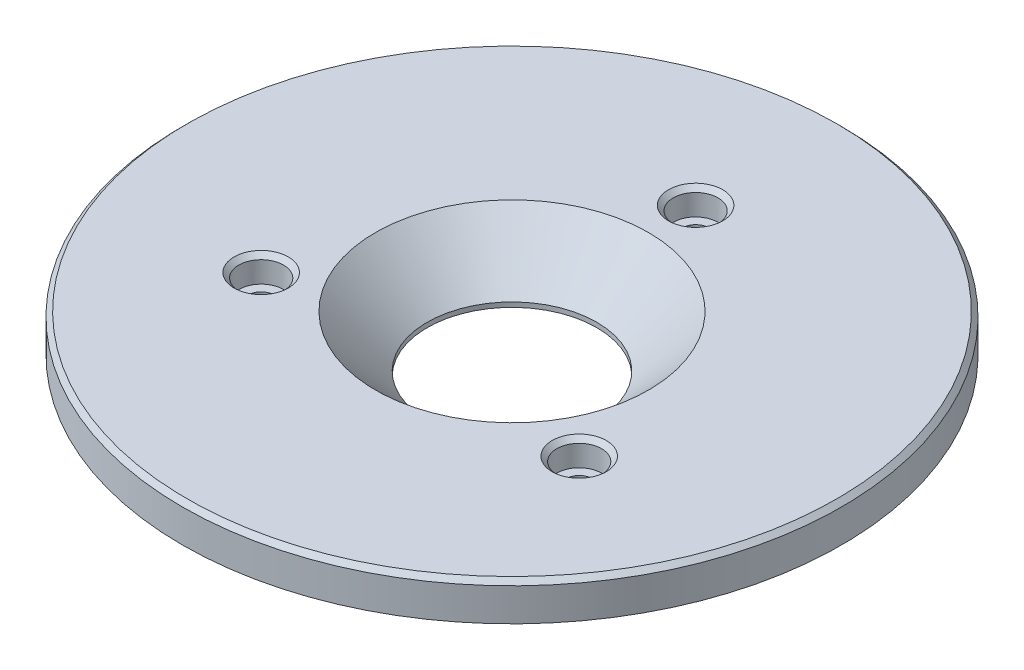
ISO-10303-21;
HEADER;
FILE_DESCRIPTION(('STEP AP214'),'2;1');
FILE_NAME('part.step','',(''),(''),'','','');
FILE_SCHEMA(('AUTOMOTIVE_DESIGN { 1 0 10303 214 1 1 1 1 }'));
ENDSEC;
DATA;
#1=APPLICATION_CONTEXT('core data for automotive mechanical design processes');
#2=APPLICATION_PROTOCOL_DEFINITION('international standard','automotive_design',2000,#1);
#3=PRODUCT_CONTEXT('',#1,'mechanical');
#4=PRODUCT('Part','Part','',(#3));
#5=PRODUCT_RELATED_PRODUCT_CATEGORY('part','',(#4));
#6=PRODUCT_DEFINITION_FORMATION('','',#4);
#7=PRODUCT_DEFINITION_CONTEXT('part definition',#1,'design');
#8=PRODUCT_DEFINITION('design','',#6,#7);
#9=PRODUCT_DEFINITION_SHAPE('','',#8);
#10=(LENGTH_UNIT() NAMED_UNIT(*) SI_UNIT(.MILLI.,.METRE.));
#11=(NAMED_UNIT(*) PLANE_ANGLE_UNIT() SI_UNIT($,.RADIAN.));
#12=(NAMED_UNIT(*) SI_UNIT($,.STERADIAN.) SOLID_ANGLE_UNIT());
#13=UNCERTAINTY_MEASURE_WITH_UNIT(LENGTH_MEASURE(1.E-05),#10,'distance_accuracy_value','');
#14=(GEOMETRIC_REPRESENTATION_CONTEXT(3) GLOBAL_UNCERTAINTY_ASSIGNED_CONTEXT((#13)) GLOBAL_UNIT_ASSIGNED_CONTEXT((#10,
#11,#12)) REPRESENTATION_CONTEXT('',''));
#15=CARTESIAN_POINT('',(0.,0.,0.));
#16=DIRECTION('',(0.,0.,1.));
#17=DIRECTION('',(1.,0.,0.));
#18=AXIS2_PLACEMENT_3D('',#15,#16,#17);
#19=CARTESIAN_POINT('',(-29.,12.,0.));
#20=DIRECTION('',(0.,-1.,0.));
#21=DIRECTION('',(0.,0.,-1.));
#22=AXIS2_PLACEMENT_3D('',#19,#20,#21);
#23=PLANE('',#22);
#24=CARTESIAN_POINT('',(33.7749907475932,12.,19.5));
#25=DIRECTION('',(0.,-1.,0.));
#26=DIRECTION('',(0.,0.,-1.));
#27=AXIS2_PLACEMENT_3D('',#24,#25,#26);
#28=CIRCLE('',#27,5.75);
#29=CARTESIAN_POINT('',(33.7749907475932,12.,13.75));
#30=VERTEX_POINT('',#29);
#31=EDGE_CURVE('E25',#30,#30,#28,.T.);
#32=ORIENTED_EDGE('',*,*,#31,.T.);
#33=EDGE_LOOP('',(#32));
#34=FACE_BOUND('',#33,.T.);
#35=CARTESIAN_POINT('',(0.,12.,-39.));
#36=DIRECTION('',(0.,-1.,0.));
#37=DIRECTION('',(0.,0.,-1.));
#38=AXIS2_PLACEMENT_3D('',#35,#36,#37);
#39=CIRCLE('',#38,5.75);
#40=CARTESIAN_POINT('',(0.,12.,-44.75));
#41=VERTEX_POINT('',#40);
#42=EDGE_CURVE('E29',#41,#41,#39,.T.);
#43=ORIENTED_EDGE('',*,*,#42,.T.);
#44=EDGE_LOOP('',(#43));
#45=FACE_BOUND('',#44,.T.);
#46=CARTESIAN_POINT('',(-33.7749907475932,12.,19.5));
#47=DIRECTION('',(0.,-1.,0.));
#48=DIRECTION('',(0.,0.,-1.));
#49=AXIS2_PLACEMENT_3D('',#46,#47,#48);
#50=CIRCLE('',#49,5.75);
#51=CARTESIAN_POINT('',(-33.7749907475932,12.,13.75));
#52=VERTEX_POINT('',#51);
#53=EDGE_CURVE('E34',#52,#52,#50,.T.);
#54=ORIENTED_EDGE('',*,*,#53,.T.);
#55=EDGE_LOOP('',(#54));
#56=FACE_BOUND('',#55,.T.);
#57=CARTESIAN_POINT('',(0.,12.,0.));
#58=DIRECTION('',(0.,-1.,0.));
#59=DIRECTION('',(0.,0.,-1.));
#60=AXIS2_PLACEMENT_3D('',#57,#58,#59);
#61=CIRCLE('',#60,69.);
#62=CARTESIAN_POINT('',(0.,12.,-69.));
#63=VERTEX_POINT('',#62);
#64=EDGE_CURVE('E58',#63,#63,#61,.F.);
#65=ORIENTED_EDGE('',*,*,#64,.T.);
#66=EDGE_LOOP('',(#65));
#67=FACE_BOUND('',#66,.T.);
#68=CARTESIAN_POINT('',(0.,12.,0.));
#69=DIRECTION('',(0.,-1.,0.));
#70=DIRECTION('',(0.,0.,-1.));
#71=AXIS2_PLACEMENT_3D('',#68,#69,#70);
#72=CIRCLE('',#71,29.);
#73=CARTESIAN_POINT('',(0.,12.,-29.));
#74=VERTEX_POINT('',#73);
#75=EDGE_CURVE('E70',#74,#74,#72,.T.);
#76=ORIENTED_EDGE('',*,*,#75,.T.);
#77=EDGE_LOOP('',(#76));
#78=FACE_BOUND('',#77,.T.);
#79=ADVANCED_FACE('F14',(#34,#45,#56,#67,#78),#23,.F.);
#80=CARTESIAN_POINT('',(0.,1.,0.));
#81=DIRECTION('',(0.,1.,0.));
#82=DIRECTION('',(0.,0.,1.));
#83=AXIS2_PLACEMENT_3D('',#80,#81,#82);
#84=CONICAL_SURFACE('',#83,18.,0.78539816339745);
#85=ORIENTED_EDGE('',*,*,#75,.F.);
#86=EDGE_LOOP('',(#85));
#87=FACE_BOUND('',#86,.T.);
#88=CARTESIAN_POINT('',(0.,1.,0.));
#89=DIRECTION('',(0.,-1.,0.));
#90=DIRECTION('',(0.,0.,-1.));
#91=AXIS2_PLACEMENT_3D('',#88,#89,#90);
#92=CIRCLE('',#91,18.);
#93=CARTESIAN_POINT('',(0.,1.,-18.));
#94=VERTEX_POINT('',#93);
#95=EDGE_CURVE('E83',#94,#94,#92,.T.);
#96=ORIENTED_EDGE('',*,*,#95,.T.);
#97=EDGE_LOOP('',(#96));
#98=FACE_BOUND('',#97,.T.);
#99=ADVANCED_FACE('F123',(#87,#98),#84,.F.);
#100=CARTESIAN_POINT('',(0.,0.,0.));
#101=DIRECTION('',(0.,-1.,0.));
#102=DIRECTION('',(0.,0.,-1.));
#103=AXIS2_PLACEMENT_3D('',#100,#101,#102);
#104=CYLINDRICAL_SURFACE('',#103,18.);
#105=ORIENTED_EDGE('',*,*,#95,.F.);
#106=EDGE_LOOP('',(#105));
#107=FACE_BOUND('',#106,.T.);
#108=CARTESIAN_POINT('',(0.,0.,0.));
#109=DIRECTION('',(0.,-1.,0.));
#110=DIRECTION('',(0.,0.,-1.));
#111=AXIS2_PLACEMENT_3D('',#108,#109,#110);
#112=CIRCLE('',#111,18.);
#113=CARTESIAN_POINT('',(0.,0.,-18.));
#114=VERTEX_POINT('',#113);
#115=EDGE_CURVE('E86',#114,#114,#112,.T.);
#116=ORIENTED_EDGE('',*,*,#115,.T.);
#117=EDGE_LOOP('',(#116));
#118=FACE_BOUND('',#117,.T.);
#119=ADVANCED_FACE('F130',(#107,#118),#104,.F.);
#120=CARTESIAN_POINT('',(-18.,0.,0.));
#121=DIRECTION('',(0.,1.,0.));
#122=DIRECTION('',(0.,0.,1.));
#123=AXIS2_PLACEMENT_3D('',#120,#121,#122);
#124=PLANE('',#123);
#125=CARTESIAN_POINT('',(-33.7749907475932,0.,19.5));
#126=DIRECTION('',(0.,1.,0.));
#127=DIRECTION('',(0.,0.,1.));
#128=AXIS2_PLACEMENT_3D('',#125,#126,#127);
#129=CIRCLE('',#128,3.75);
#130=CARTESIAN_POINT('',(-33.7749907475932,0.,23.25));
#131=VERTEX_POINT('',#130);
#132=EDGE_CURVE('E49',#131,#131,#129,.T.);
#133=ORIENTED_EDGE('',*,*,#132,.T.);
#134=EDGE_LOOP('',(#133));
#135=FACE_BOUND('',#134,.T.);
#136=CARTESIAN_POINT('',(33.7749907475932,0.,19.5));
#137=DIRECTION('',(0.,1.,0.));
#138=DIRECTION('',(0.,0.,1.));
#139=AXIS2_PLACEMENT_3D('',#136,#137,#138);
#140=CIRCLE('',#139,3.75);
#141=CARTESIAN_POINT('',(33.7749907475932,0.,23.25));
#142=VERTEX_POINT('',#141);
#143=EDGE_CURVE('E52',#142,#142,#140,.T.);
#144=ORIENTED_EDGE('',*,*,#143,.T.);
#145=EDGE_LOOP('',(#144));
#146=FACE_BOUND('',#145,.T.);
#147=CARTESIAN_POINT('',(0.,0.,-39.));
#148=DIRECTION('',(0.,1.,0.));
#149=DIRECTION('',(0.,0.,1.));
#150=AXIS2_PLACEMENT_3D('',#147,#148,#149);
#151=CIRCLE('',#150,3.75);
#152=CARTESIAN_POINT('',(0.,0.,-35.25));
#153=VERTEX_POINT('',#152);
#154=EDGE_CURVE('E55',#153,#153,#151,.T.);
#155=ORIENTED_EDGE('',*,*,#154,.T.);
#156=EDGE_LOOP('',(#155));
#157=FACE_BOUND('',#156,.T.);
#158=CARTESIAN_POINT('',(0.,0.,0.));
#159=DIRECTION('',(0.,1.,0.));
#160=DIRECTION('',(0.,0.,1.));
#161=AXIS2_PLACEMENT_3D('',#158,#159,#160);
#162=CIRCLE('',#161,44.);
#163=CARTESIAN_POINT('',(0.,0.,44.));
#164=VERTEX_POINT('',#163);
#165=EDGE_CURVE('E67',#164,#164,#162,.F.);
#166=ORIENTED_EDGE('',*,*,#165,.T.);
#167=EDGE_LOOP('',(#166));
#168=FACE_BOUND('',#167,.T.);
#169=ORIENTED_EDGE('',*,*,#115,.F.);
#170=EDGE_LOOP('',(#169));
#171=FACE_BOUND('',#170,.T.);
#172=ADVANCED_FACE('F181',(#135,#146,#157,#168,#171),#124,.F.);
#173=CARTESIAN_POINT('',(0.,0.,0.));
#174=DIRECTION('',(0.,-1.,0.));
#175=DIRECTION('',(0.,0.,-1.));
#176=AXIS2_PLACEMENT_3D('',#173,#174,#175);
#177=CYLINDRICAL_SURFACE('',#176,45.);
#178=CARTESIAN_POINT('',(0.,0.999999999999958,0.));
#179=DIRECTION('',(0.,1.,0.));
#180=DIRECTION('',(0.,0.,1.));
#181=AXIS2_PLACEMENT_3D('',#178,#179,#180);
#182=CIRCLE('',#181,45.);
#183=CARTESIAN_POINT('',(0.,0.999999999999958,45.));
#184=VERTEX_POINT('',#183);
#185=EDGE_CURVE('E64',#184,#184,#182,.T.);
#186=ORIENTED_EDGE('',*,*,#185,.T.);
#187=EDGE_LOOP('',(#186));
#188=FACE_BOUND('',#187,.T.);
#189=CARTESIAN_POINT('',(0.,4.,0.));
#190=DIRECTION('',(0.,-1.,0.));
#191=DIRECTION('',(0.,0.,-1.));
#192=AXIS2_PLACEMENT_3D('',#189,#190,#191);
#193=CIRCLE('',#192,45.);
#194=CARTESIAN_POINT('',(0.,4.,-45.));
#195=VERTEX_POINT('',#194);
#196=EDGE_CURVE('E89',#195,#195,#193,.T.);
#197=ORIENTED_EDGE('',*,*,#196,.T.);
#198=EDGE_LOOP('',(#197));
#199=FACE_BOUND('',#198,.T.);
#200=ADVANCED_FACE('F185',(#188,#199),#177,.T.);
#201=CARTESIAN_POINT('',(-45.,4.,0.));
#202=DIRECTION('',(0.,1.,0.));
#203=DIRECTION('',(0.,0.,1.));
#204=AXIS2_PLACEMENT_3D('',#201,#202,#203);
#205=PLANE('',#204);
#206=ORIENTED_EDGE('',*,*,#196,.F.);
#207=EDGE_LOOP('',(#206));
#208=FACE_BOUND('',#207,.T.);
#209=CARTESIAN_POINT('',(0.,4.,0.));
#210=DIRECTION('',(0.,-1.,0.));
#211=DIRECTION('',(0.,0.,-1.));
#212=AXIS2_PLACEMENT_3D('',#209,#210,#211);
#213=CIRCLE('',#212,70.);
#214=CARTESIAN_POINT('',(0.,4.,-70.));
#215=VERTEX_POINT('',#214);
#216=EDGE_CURVE('E92',#215,#215,#213,.T.);
#217=ORIENTED_EDGE('',*,*,#216,.T.);
#218=EDGE_LOOP('',(#217));
#219=FACE_BOUND('',#218,.T.);
#220=ADVANCED_FACE('F192',(#208,#219),#205,.F.);
#221=CARTESIAN_POINT('',(0.,0.,0.));
#222=DIRECTION('',(0.,-1.,0.));
#223=DIRECTION('',(0.,0.,-1.));
#224=AXIS2_PLACEMENT_3D('',#221,#222,#223);
#225=CYLINDRICAL_SURFACE('',#224,70.);
#226=CARTESIAN_POINT('',(0.,11.,0.));
#227=DIRECTION('',(0.,-1.,0.));
#228=DIRECTION('',(0.,0.,-1.));
#229=AXIS2_PLACEMENT_3D('',#226,#227,#228);
#230=CIRCLE('',#229,70.);
#231=CARTESIAN_POINT('',(0.,11.,-70.));
#232=VERTEX_POINT('',#231);
#233=EDGE_CURVE('E61',#232,#232,#230,.T.);
#234=ORIENTED_EDGE('',*,*,#233,.T.);
#235=EDGE_LOOP('',(#234));
#236=FACE_BOUND('',#235,.T.);
#237=ORIENTED_EDGE('',*,*,#216,.F.);
#238=EDGE_LOOP('',(#237));
#239=FACE_BOUND('',#238,.T.);
#240=ADVANCED_FACE('F199',(#236,#239),#225,.T.);
#241=CARTESIAN_POINT('',(33.7749907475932,6.5,19.5));
#242=DIRECTION('',(0.,1.,0.));
#243=DIRECTION('',(0.,0.,1.));
#244=AXIS2_PLACEMENT_3D('',#241,#242,#243);
#245=CYLINDRICAL_SURFACE('',#244,4.75);
#246=CARTESIAN_POINT('',(33.7749907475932,11.,19.5));
#247=DIRECTION('',(0.,-1.,0.));
#248=DIRECTION('',(0.,0.,-1.));
#249=AXIS2_PLACEMENT_3D('',#246,#247,#248);
#250=CIRCLE('',#249,4.75);
#251=CARTESIAN_POINT('',(33.7749907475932,11.,14.75));
#252=VERTEX_POINT('',#251);
#253=EDGE_CURVE('E37',#252,#252,#250,.F.);
#254=ORIENTED_EDGE('',*,*,#253,.T.);
#255=EDGE_LOOP('',(#254));
#256=FACE_BOUND('',#255,.T.);
#257=CARTESIAN_POINT('',(33.7749907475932,6.5,19.5));
#258=DIRECTION('',(0.,1.,0.));
#259=DIRECTION('',(0.,0.,-1.));
#260=AXIS2_PLACEMENT_3D('',#257,#258,#259);
#261=CIRCLE('',#260,4.75);
#262=CARTESIAN_POINT('',(33.7749907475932,6.5,14.75));
#263=VERTEX_POINT('',#262);
#264=EDGE_CURVE('E74',#263,#263,#261,.T.);
#265=ORIENTED_EDGE('',*,*,#264,.F.);
#266=EDGE_LOOP('',(#265));
#267=FACE_BOUND('',#266,.T.);
#268=ADVANCED_FACE('F203',(#256,#267),#245,.F.);
#269=CARTESIAN_POINT('',(33.7749907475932,6.5,19.5));
#270=DIRECTION('',(0.,-1.,0.));
#271=DIRECTION('',(0.,0.,-1.));
#272=AXIS2_PLACEMENT_3D('',#269,#270,#271);
#273=PLANE('',#272);
#274=CARTESIAN_POINT('',(33.7749907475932,6.5,19.5));
#275=DIRECTION('',(0.,-1.,0.));
#276=DIRECTION('',(0.,0.,-1.));
#277=AXIS2_PLACEMENT_3D('',#274,#275,#276);
#278=CIRCLE('',#277,2.75);
#279=CARTESIAN_POINT('',(33.7749907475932,6.5,16.75));
#280=VERTEX_POINT('',#279);
#281=EDGE_CURVE('E71',#280,#280,#278,.T.);
#282=ORIENTED_EDGE('',*,*,#281,.T.);
#283=EDGE_LOOP('',(#282));
#284=FACE_BOUND('',#283,.T.);
#285=ORIENTED_EDGE('',*,*,#264,.T.);
#286=EDGE_LOOP('',(#285));
#287=FACE_BOUND('',#286,.T.);
#288=ADVANCED_FACE('F207',(#284,#287),#273,.F.);
#289=CARTESIAN_POINT('',(-33.7749907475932,6.5,19.5));
#290=DIRECTION('',(0.,1.,0.));
#291=DIRECTION('',(0.,0.,1.));
#292=AXIS2_PLACEMENT_3D('',#289,#290,#291);
#293=CYLINDRICAL_SURFACE('',#292,4.75);
#294=CARTESIAN_POINT('',(-33.7749907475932,11.,19.5));
#295=DIRECTION('',(0.,-1.,0.));
#296=DIRECTION('',(0.,0.,-1.));
#297=AXIS2_PLACEMENT_3D('',#294,#295,#296);
#298=CIRCLE('',#297,4.75);
#299=CARTESIAN_POINT('',(-33.7749907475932,11.,14.75));
#300=VERTEX_POINT('',#299);
#301=EDGE_CURVE('E9',#300,#300,#298,.F.);
#302=ORIENTED_EDGE('',*,*,#301,.T.);
#303=EDGE_LOOP('',(#302));
#304=FACE_BOUND('',#303,.T.);
#305=CARTESIAN_POINT('',(-33.7749907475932,6.5,19.5));
#306=DIRECTION('',(0.,1.,0.));
#307=DIRECTION('',(0.,0.,1.));
#308=AXIS2_PLACEMENT_3D('',#305,#306,#307);
#309=CIRCLE('',#308,4.75);
#310=CARTESIAN_POINT('',(-33.7749907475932,6.5,24.25));
#311=VERTEX_POINT('',#310);
#312=EDGE_CURVE('E98',#311,#311,#309,.T.);
#313=ORIENTED_EDGE('',*,*,#312,.F.);
#314=EDGE_LOOP('',(#313));
#315=FACE_BOUND('',#314,.T.);
#316=ADVANCED_FACE('F119',(#304,#315),#293,.F.);
#317=CARTESIAN_POINT('',(-33.7749907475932,6.5,19.5));
#318=DIRECTION('',(0.,1.,0.));
#319=DIRECTION('',(0.,0.,1.));
#320=AXIS2_PLACEMENT_3D('',#317,#318,#319);
#321=PLANE('',#320);
#322=CARTESIAN_POINT('',(-33.7749907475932,6.5,19.5));
#323=DIRECTION('',(0.,1.,0.));
#324=DIRECTION('',(0.,0.,1.));
#325=AXIS2_PLACEMENT_3D('',#322,#323,#324);
#326=CIRCLE('',#325,2.75);
#327=CARTESIAN_POINT('',(-33.7749907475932,6.5,22.25));
#328=VERTEX_POINT('',#327);
#329=EDGE_CURVE('E75',#328,#328,#326,.T.);
#330=ORIENTED_EDGE('',*,*,#329,.F.);
#331=EDGE_LOOP('',(#330));
#332=FACE_BOUND('',#331,.T.);
#333=ORIENTED_EDGE('',*,*,#312,.T.);
#334=EDGE_LOOP('',(#333));
#335=FACE_BOUND('',#334,.T.);
#336=ADVANCED_FACE('F108',(#332,#335),#321,.T.);
#337=CARTESIAN_POINT('',(0.,6.5,-39.));
#338=DIRECTION('',(0.,1.,0.));
#339=DIRECTION('',(0.,0.,1.));
#340=AXIS2_PLACEMENT_3D('',#337,#338,#339);
#341=CYLINDRICAL_SURFACE('',#340,4.75);
#342=CARTESIAN_POINT('',(0.,11.,-39.));
#343=DIRECTION('',(0.,-1.,0.));
#344=DIRECTION('',(0.,0.,-1.));
#345=AXIS2_PLACEMENT_3D('',#342,#343,#344);
#346=CIRCLE('',#345,4.75);
#347=CARTESIAN_POINT('',(0.,11.,-43.75));
#348=VERTEX_POINT('',#347);
#349=EDGE_CURVE('E21',#348,#348,#346,.F.);
#350=ORIENTED_EDGE('',*,*,#349,.T.);
#351=EDGE_LOOP('',(#350));
#352=FACE_BOUND('',#351,.T.);
#353=CARTESIAN_POINT('',(0.,6.5,-39.));
#354=DIRECTION('',(0.,1.,0.));
#355=DIRECTION('',(0.,0.,1.));
#356=AXIS2_PLACEMENT_3D('',#353,#354,#355);
#357=CIRCLE('',#356,4.75);
#358=CARTESIAN_POINT('',(0.,6.5,-34.25));
#359=VERTEX_POINT('',#358);
#360=EDGE_CURVE('E95',#359,#359,#357,.T.);
#361=ORIENTED_EDGE('',*,*,#360,.F.);
#362=EDGE_LOOP('',(#361));
#363=FACE_BOUND('',#362,.T.);
#364=ADVANCED_FACE('F106',(#352,#363),#341,.F.);
#365=CARTESIAN_POINT('',(0.,6.5,-39.));
#366=DIRECTION('',(0.,1.,0.));
#367=DIRECTION('',(0.,0.,1.));
#368=AXIS2_PLACEMENT_3D('',#365,#366,#367);
#369=PLANE('',#368);
#370=CARTESIAN_POINT('',(0.,6.5,-39.));
#371=DIRECTION('',(0.,1.,0.));
#372=DIRECTION('',(0.,0.,1.));
#373=AXIS2_PLACEMENT_3D('',#370,#371,#372);
#374=CIRCLE('',#373,2.75);
#375=CARTESIAN_POINT('',(0.,6.5,-36.25));
#376=VERTEX_POINT('',#375);
#377=EDGE_CURVE('E78',#376,#376,#374,.T.);
#378=ORIENTED_EDGE('',*,*,#377,.F.);
#379=EDGE_LOOP('',(#378));
#380=FACE_BOUND('',#379,.T.);
#381=ORIENTED_EDGE('',*,*,#360,.T.);
#382=EDGE_LOOP('',(#381));
#383=FACE_BOUND('',#382,.T.);
#384=ADVANCED_FACE('F104',(#380,#383),#369,.T.);
#385=CARTESIAN_POINT('',(0.,0.,-39.));
#386=DIRECTION('',(0.,1.,0.));
#387=DIRECTION('',(0.,0.,1.));
#388=AXIS2_PLACEMENT_3D('',#385,#386,#387);
#389=CYLINDRICAL_SURFACE('',#388,2.75);
#390=CARTESIAN_POINT('',(0.,1.,-39.));
#391=DIRECTION('',(0.,1.,0.));
#392=DIRECTION('',(0.,0.,1.));
#393=AXIS2_PLACEMENT_3D('',#390,#391,#392);
#394=CIRCLE('',#393,2.75);
#395=CARTESIAN_POINT('',(0.,1.,-36.25));
#396=VERTEX_POINT('',#395);
#397=EDGE_CURVE('E40',#396,#396,#394,.F.);
#398=ORIENTED_EDGE('',*,*,#397,.T.);
#399=EDGE_LOOP('',(#398));
#400=FACE_BOUND('',#399,.T.);
#401=ORIENTED_EDGE('',*,*,#377,.T.);
#402=EDGE_LOOP('',(#401));
#403=FACE_BOUND('',#402,.T.);
#404=ADVANCED_FACE('F116',(#400,#403),#389,.F.);
#405=CARTESIAN_POINT('',(-33.7749907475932,0.,19.5));
#406=DIRECTION('',(0.,1.,0.));
#407=DIRECTION('',(0.,0.,1.));
#408=AXIS2_PLACEMENT_3D('',#405,#406,#407);
#409=CYLINDRICAL_SURFACE('',#408,2.75);
#410=CARTESIAN_POINT('',(-33.7749907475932,1.,19.5));
#411=DIRECTION('',(0.,1.,0.));
#412=DIRECTION('',(0.,0.,1.));
#413=AXIS2_PLACEMENT_3D('',#410,#411,#412);
#414=CIRCLE('',#413,2.75);
#415=CARTESIAN_POINT('',(-33.7749907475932,1.,22.25));
#416=VERTEX_POINT('',#415);
#417=EDGE_CURVE('E46',#416,#416,#414,.F.);
#418=ORIENTED_EDGE('',*,*,#417,.T.);
#419=EDGE_LOOP('',(#418));
#420=FACE_BOUND('',#419,.T.);
#421=ORIENTED_EDGE('',*,*,#329,.T.);
#422=EDGE_LOOP('',(#421));
#423=FACE_BOUND('',#422,.T.);
#424=ADVANCED_FACE('F338',(#420,#423),#409,.F.);
#425=CARTESIAN_POINT('',(33.7749907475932,0.,19.5));
#426=DIRECTION('',(0.,1.,0.));
#427=DIRECTION('',(0.,0.,1.));
#428=AXIS2_PLACEMENT_3D('',#425,#426,#427);
#429=CYLINDRICAL_SURFACE('',#428,2.75);
#430=CARTESIAN_POINT('',(33.7749907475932,1.,19.5));
#431=DIRECTION('',(0.,1.,0.));
#432=DIRECTION('',(0.,0.,1.));
#433=AXIS2_PLACEMENT_3D('',#430,#431,#432);
#434=CIRCLE('',#433,2.75);
#435=CARTESIAN_POINT('',(33.7749907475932,1.,22.25));
#436=VERTEX_POINT('',#435);
#437=EDGE_CURVE('E43',#436,#436,#434,.F.);
#438=ORIENTED_EDGE('',*,*,#437,.T.);
#439=EDGE_LOOP('',(#438));
#440=FACE_BOUND('',#439,.T.);
#441=ORIENTED_EDGE('',*,*,#281,.F.);
#442=EDGE_LOOP('',(#441));
#443=FACE_BOUND('',#442,.T.);
#444=ADVANCED_FACE('F140',(#440,#443),#429,.F.);
#445=CARTESIAN_POINT('',(0.,0.,0.));
#446=DIRECTION('',(0.,1.,0.));
#447=DIRECTION('',(0.,0.,1.));
#448=AXIS2_PLACEMENT_3D('',#445,#446,#447);
#449=CONICAL_SURFACE('',#448,44.,0.785398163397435);
#450=ORIENTED_EDGE('',*,*,#185,.F.);
#451=EDGE_LOOP('',(#450));
#452=FACE_BOUND('',#451,.T.);
#453=ORIENTED_EDGE('',*,*,#165,.F.);
#454=EDGE_LOOP('',(#453));
#455=FACE_BOUND('',#454,.T.);
#456=ADVANCED_FACE('F136',(#452,#455),#449,.T.);
#457=CARTESIAN_POINT('',(0.,11.,0.));
#458=DIRECTION('',(0.,-1.,0.));
#459=DIRECTION('',(0.,0.,-1.));
#460=AXIS2_PLACEMENT_3D('',#457,#458,#459);
#461=CONICAL_SURFACE('',#460,70.,0.785398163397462);
#462=ORIENTED_EDGE('',*,*,#64,.F.);
#463=EDGE_LOOP('',(#462));
#464=FACE_BOUND('',#463,.T.);
#465=ORIENTED_EDGE('',*,*,#233,.F.);
#466=EDGE_LOOP('',(#465));
#467=FACE_BOUND('',#466,.T.);
#468=ADVANCED_FACE('F139',(#464,#467),#461,.T.);
#469=CARTESIAN_POINT('',(-33.7749907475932,0.,19.5));
#470=DIRECTION('',(0.,-1.,0.));
#471=DIRECTION('',(0.,0.,-1.));
#472=AXIS2_PLACEMENT_3D('',#469,#470,#471);
#473=CONICAL_SURFACE('',#472,3.75,0.785398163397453);
#474=ORIENTED_EDGE('',*,*,#417,.F.);
#475=EDGE_LOOP('',(#474));
#476=FACE_BOUND('',#475,.T.);
#477=ORIENTED_EDGE('',*,*,#132,.F.);
#478=EDGE_LOOP('',(#477));
#479=FACE_BOUND('',#478,.T.);
#480=ADVANCED_FACE('F144',(#476,#479),#473,.F.);
#481=CARTESIAN_POINT('',(33.7749907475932,0.,19.5));
#482=DIRECTION('',(0.,-1.,0.));
#483=DIRECTION('',(0.,0.,-1.));
#484=AXIS2_PLACEMENT_3D('',#481,#482,#483);
#485=CONICAL_SURFACE('',#484,3.75,0.785398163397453);
#486=ORIENTED_EDGE('',*,*,#437,.F.);
#487=EDGE_LOOP('',(#486));
#488=FACE_BOUND('',#487,.T.);
#489=ORIENTED_EDGE('',*,*,#143,.F.);
#490=EDGE_LOOP('',(#489));
#491=FACE_BOUND('',#490,.T.);
#492=ADVANCED_FACE('F148',(#488,#491),#485,.F.);
#493=CARTESIAN_POINT('',(0.,0.,-39.));
#494=DIRECTION('',(0.,-1.,0.));
#495=DIRECTION('',(0.,0.,-1.));
#496=AXIS2_PLACEMENT_3D('',#493,#494,#495);
#497=CONICAL_SURFACE('',#496,3.75,0.785398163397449);
#498=ORIENTED_EDGE('',*,*,#397,.F.);
#499=EDGE_LOOP('',(#498));
#500=FACE_BOUND('',#499,.T.);
#501=ORIENTED_EDGE('',*,*,#154,.F.);
#502=EDGE_LOOP('',(#501));
#503=FACE_BOUND('',#502,.T.);
#504=ADVANCED_FACE('F152',(#500,#503),#497,.F.);
#505=CARTESIAN_POINT('',(33.7749907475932,11.,19.5));
#506=DIRECTION('',(0.,1.,0.));
#507=DIRECTION('',(0.,0.,1.));
#508=AXIS2_PLACEMENT_3D('',#505,#506,#507);
#509=CONICAL_SURFACE('',#508,4.75,0.785398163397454);
#510=ORIENTED_EDGE('',*,*,#31,.F.);
#511=EDGE_LOOP('',(#510));
#512=FACE_BOUND('',#511,.T.);
#513=ORIENTED_EDGE('',*,*,#253,.F.);
#514=EDGE_LOOP('',(#513));
#515=FACE_BOUND('',#514,.T.);
#516=ADVANCED_FACE('F156',(#512,#515),#509,.F.);
#517=CARTESIAN_POINT('',(0.,11.,-39.));
#518=DIRECTION('',(0.,1.,0.));
#519=DIRECTION('',(0.,0.,1.));
#520=AXIS2_PLACEMENT_3D('',#517,#518,#519);
#521=CONICAL_SURFACE('',#520,4.75,0.785398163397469);
#522=ORIENTED_EDGE('',*,*,#42,.F.);
#523=EDGE_LOOP('',(#522));
#524=FACE_BOUND('',#523,.T.);
#525=ORIENTED_EDGE('',*,*,#349,.F.);
#526=EDGE_LOOP('',(#525));
#527=FACE_BOUND('',#526,.T.);
#528=ADVANCED_FACE('F159',(#524,#527),#521,.F.);
#529=CARTESIAN_POINT('',(-33.7749907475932,11.,19.5));
#530=DIRECTION('',(0.,1.,0.));
#531=DIRECTION('',(0.,0.,1.));
#532=AXIS2_PLACEMENT_3D('',#529,#530,#531);
#533=CONICAL_SURFACE('',#532,4.75,0.785398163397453);
#534=ORIENTED_EDGE('',*,*,#53,.F.);
#535=EDGE_LOOP('',(#534));
#536=FACE_BOUND('',#535,.T.);
#537=ORIENTED_EDGE('',*,*,#301,.F.);
#538=EDGE_LOOP('',(#537));
#539=FACE_BOUND('',#538,.T.);
#540=ADVANCED_FACE('F16',(#536,#539),#533,.F.);
#541=CLOSED_SHELL('',(#79,#99,#119,#172,#200,#220,#240,#268,#288,#316,#336,#364,#384,#404,#424,
#444,#456,#468,#480,#492,#504,#516,#528,#540));
#542=MANIFOLD_SOLID_BREP('B1',#541);
#543=ADVANCED_BREP_SHAPE_REPRESENTATION('',(#18,#542),#14);
#544=SHAPE_DEFINITION_REPRESENTATION(#9,#543);
ENDSEC;
END-ISO-10303-21;
